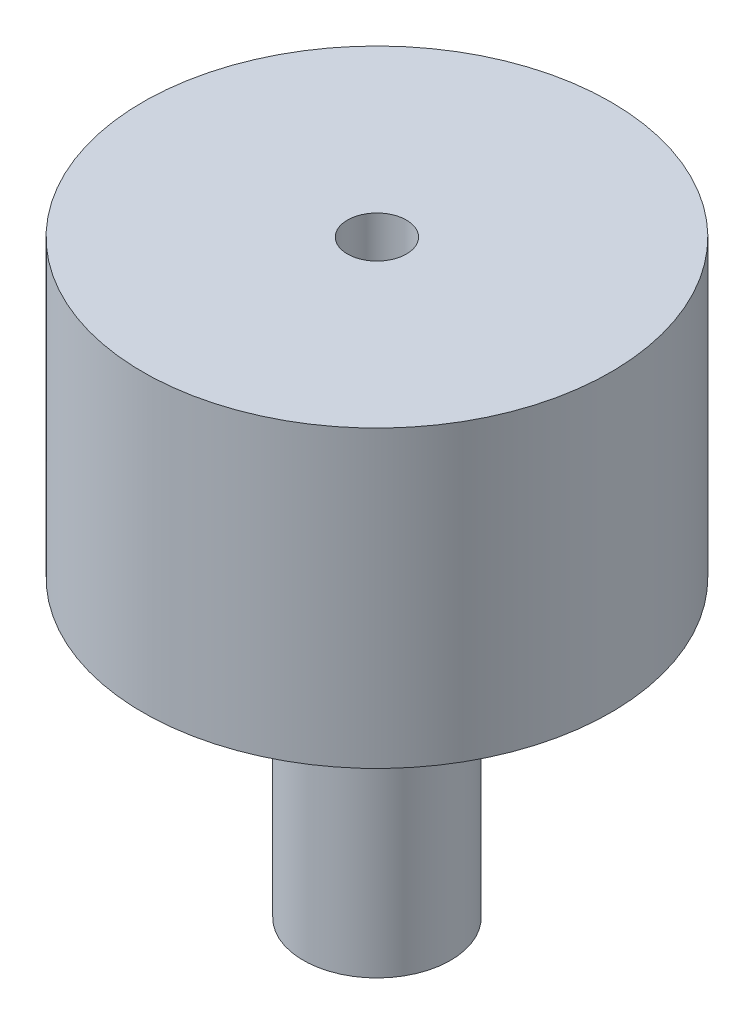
from build123d import *

# Parameters (mm, degrees)
F_0_4_0_4_DIAMETER_HOLE1_D = 0.4


with BuildPart() as part:
    # Sketch2 → Revolve1 (revolve)
    with BuildSketch(Plane(origin=(0, 0, 0), x_dir=(0, 0, -1), z_dir=(1, 0, 0)), mode=Mode.PRIVATE) as revolve1_sk:
        Polygon((0, 2), (-1.5875, 2), (-1.5875, 0), (-0.5, 0), (-0.5, -2), (0, -2), align=None)
    revolve(revolve1_sk.sketch.rotate(Axis((0, -50, 0), (0, 1, 0)), 180), axis=Axis((0, -50, 0), (0, 1, 0)))

    # 0.4 _0.4_ Diameter Hole1 (through all)
    with Locations(Plane(origin=(0, 2, 0), x_dir=(1, 0, 0), z_dir=(0, 1, 0))):
        with Locations((0, 0)):
            Hole(F_0_4_0_4_DIAMETER_HOLE1_D / 2)


solid = part.part
